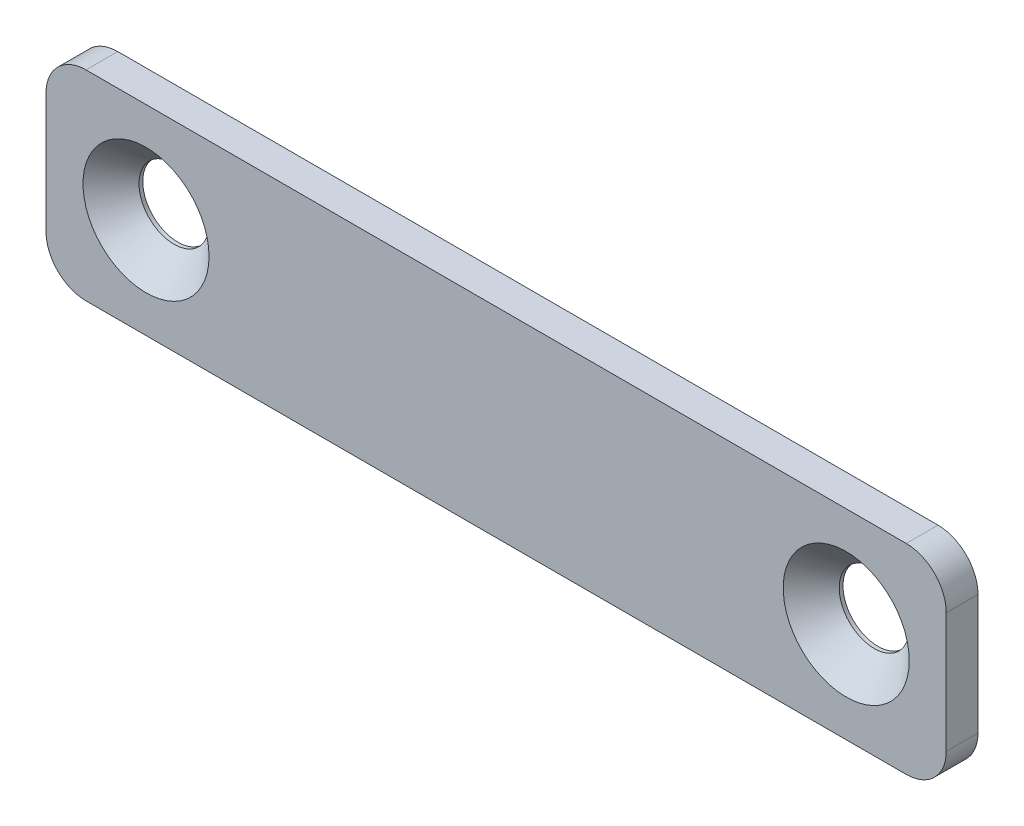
ISO-10303-21;
HEADER;
FILE_DESCRIPTION(('STEP AP214'),'2;1');
FILE_NAME('part.step','',(''),(''),'','','');
FILE_SCHEMA(('AUTOMOTIVE_DESIGN { 1 0 10303 214 1 1 1 1 }'));
ENDSEC;
DATA;
#1=APPLICATION_CONTEXT('core data for automotive mechanical design processes');
#2=APPLICATION_PROTOCOL_DEFINITION('international standard','automotive_design',2000,#1);
#3=PRODUCT_CONTEXT('',#1,'mechanical');
#4=PRODUCT('Part','Part','',(#3));
#5=PRODUCT_RELATED_PRODUCT_CATEGORY('part','',(#4));
#6=PRODUCT_DEFINITION_FORMATION('','',#4);
#7=PRODUCT_DEFINITION_CONTEXT('part definition',#1,'design');
#8=PRODUCT_DEFINITION('design','',#6,#7);
#9=PRODUCT_DEFINITION_SHAPE('','',#8);
#10=(LENGTH_UNIT() NAMED_UNIT(*) SI_UNIT(.MILLI.,.METRE.));
#11=(NAMED_UNIT(*) PLANE_ANGLE_UNIT() SI_UNIT($,.RADIAN.));
#12=(NAMED_UNIT(*) SI_UNIT($,.STERADIAN.) SOLID_ANGLE_UNIT());
#13=UNCERTAINTY_MEASURE_WITH_UNIT(LENGTH_MEASURE(1.E-05),#10,'distance_accuracy_value','');
#14=(GEOMETRIC_REPRESENTATION_CONTEXT(3) GLOBAL_UNCERTAINTY_ASSIGNED_CONTEXT((#13)) GLOBAL_UNIT_ASSIGNED_CONTEXT((#10,
#11,#12)) REPRESENTATION_CONTEXT('',''));
#15=CARTESIAN_POINT('',(0.,0.,0.));
#16=DIRECTION('',(0.,0.,1.));
#17=DIRECTION('',(1.,0.,0.));
#18=AXIS2_PLACEMENT_3D('',#15,#16,#17);
#19=CARTESIAN_POINT('',(0.,0.,1.5875));
#20=DIRECTION('',(0.,0.,-1.));
#21=DIRECTION('',(-1.,0.,0.));
#22=AXIS2_PLACEMENT_3D('',#19,#20,#21);
#23=PLANE('',#22);
#24=CARTESIAN_POINT('',(-17.5,0.,1.5875));
#25=DIRECTION('',(0.,0.,1.));
#26=DIRECTION('',(1.,0.,0.));
#27=AXIS2_PLACEMENT_3D('',#24,#25,#26);
#28=CIRCLE('',#27,3.15);
#29=CARTESIAN_POINT('',(-14.35,0.,1.5875));
#30=VERTEX_POINT('',#29);
#31=EDGE_CURVE('E202',#30,#30,#28,.T.);
#32=ORIENTED_EDGE('',*,*,#31,.F.);
#33=EDGE_LOOP('',(#32));
#34=FACE_BOUND('',#33,.T.);
#35=DIRECTION('',(-1.,0.,0.));
#36=VECTOR('',#35,1.);
#37=CARTESIAN_POINT('',(-22.5,4.99999999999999,1.5875));
#38=LINE('',#37,#36);
#39=CARTESIAN_POINT('',(20.4999999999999,4.99999999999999,1.5875));
#40=VERTEX_POINT('',#39);
#41=CARTESIAN_POINT('',(-20.5,4.99999999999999,1.5875));
#42=VERTEX_POINT('',#41);
#43=EDGE_CURVE('E210',#40,#42,#38,.T.);
#44=ORIENTED_EDGE('',*,*,#43,.T.);
#45=CARTESIAN_POINT('',(-20.5,2.99999999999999,1.5875));
#46=DIRECTION('',(0.,0.,-1.));
#47=DIRECTION('',(-1.,0.,0.));
#48=AXIS2_PLACEMENT_3D('',#45,#46,#47);
#49=CIRCLE('',#48,2.);
#50=CARTESIAN_POINT('',(-22.5,2.99999999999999,1.5875));
#51=VERTEX_POINT('',#50);
#52=EDGE_CURVE('E172',#42,#51,#49,.F.);
#53=ORIENTED_EDGE('',*,*,#52,.T.);
#54=DIRECTION('',(0.,-1.,0.));
#55=VECTOR('',#54,1.);
#56=CARTESIAN_POINT('',(-22.5,-5.00000000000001,1.5875));
#57=LINE('',#56,#55);
#58=CARTESIAN_POINT('',(-22.5,-3.00000000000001,1.5875));
#59=VERTEX_POINT('',#58);
#60=EDGE_CURVE('E128',#51,#59,#57,.T.);
#61=ORIENTED_EDGE('',*,*,#60,.T.);
#62=CARTESIAN_POINT('',(-20.5,-3.00000000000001,1.5875));
#63=DIRECTION('',(0.,0.,-1.));
#64=DIRECTION('',(-1.,0.,0.));
#65=AXIS2_PLACEMENT_3D('',#62,#63,#64);
#66=CIRCLE('',#65,2.);
#67=CARTESIAN_POINT('',(-20.5,-5.00000000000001,1.5875));
#68=VERTEX_POINT('',#67);
#69=EDGE_CURVE('E63',#59,#68,#66,.F.);
#70=ORIENTED_EDGE('',*,*,#69,.T.);
#71=DIRECTION('',(1.,0.,0.));
#72=VECTOR('',#71,1.);
#73=CARTESIAN_POINT('',(-22.5,-5.00000000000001,1.5875));
#74=LINE('',#73,#72);
#75=CARTESIAN_POINT('',(20.4999999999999,-5.00000000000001,1.5875));
#76=VERTEX_POINT('',#75);
#77=EDGE_CURVE('E151',#68,#76,#74,.T.);
#78=ORIENTED_EDGE('',*,*,#77,.T.);
#79=CARTESIAN_POINT('',(20.5,-3.00000000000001,1.5875));
#80=DIRECTION('',(0.,0.,-1.));
#81=DIRECTION('',(-1.,0.,0.));
#82=AXIS2_PLACEMENT_3D('',#79,#80,#81);
#83=CIRCLE('',#82,2.);
#84=CARTESIAN_POINT('',(22.5,-3.00000000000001,1.5875));
#85=VERTEX_POINT('',#84);
#86=EDGE_CURVE('E167',#76,#85,#83,.F.);
#87=ORIENTED_EDGE('',*,*,#86,.T.);
#88=DIRECTION('',(0.,1.,0.));
#89=VECTOR('',#88,1.);
#90=CARTESIAN_POINT('',(22.5,-5.00000000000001,1.5875));
#91=LINE('',#90,#89);
#92=CARTESIAN_POINT('',(22.5,2.99999999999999,1.5875));
#93=VERTEX_POINT('',#92);
#94=EDGE_CURVE('E143',#85,#93,#91,.T.);
#95=ORIENTED_EDGE('',*,*,#94,.T.);
#96=CARTESIAN_POINT('',(20.5,2.99999999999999,1.5875));
#97=DIRECTION('',(0.,0.,-1.));
#98=DIRECTION('',(-1.,0.,0.));
#99=AXIS2_PLACEMENT_3D('',#96,#97,#98);
#100=CIRCLE('',#99,2.);
#101=EDGE_CURVE('E164',#93,#40,#100,.F.);
#102=ORIENTED_EDGE('',*,*,#101,.T.);
#103=EDGE_LOOP('',(#44,#53,#61,#70,#78,#87,#95,#102));
#104=FACE_BOUND('',#103,.T.);
#105=CARTESIAN_POINT('',(17.5,0.,1.5875));
#106=DIRECTION('',(0.,0.,1.));
#107=DIRECTION('',(1.,0.,0.));
#108=AXIS2_PLACEMENT_3D('',#105,#106,#107);
#109=CIRCLE('',#108,3.15);
#110=CARTESIAN_POINT('',(20.65,0.,1.5875));
#111=VERTEX_POINT('',#110);
#112=EDGE_CURVE('E186',#111,#111,#109,.T.);
#113=ORIENTED_EDGE('',*,*,#112,.F.);
#114=EDGE_LOOP('',(#113));
#115=FACE_BOUND('',#114,.T.);
#116=ADVANCED_FACE('F38',(#34,#104,#115),#23,.F.);
#117=CARTESIAN_POINT('',(0.,0.,0.));
#118=DIRECTION('',(0.,0.,-1.));
#119=DIRECTION('',(-1.,0.,0.));
#120=AXIS2_PLACEMENT_3D('',#117,#118,#119);
#121=PLANE('',#120);
#122=CARTESIAN_POINT('',(17.5,0.,0.));
#123=DIRECTION('',(0.,0.,1.));
#124=DIRECTION('',(1.,0.,0.));
#125=AXIS2_PLACEMENT_3D('',#122,#123,#124);
#126=CIRCLE('',#125,1.75);
#127=CARTESIAN_POINT('',(19.25,0.,0.));
#128=VERTEX_POINT('',#127);
#129=EDGE_CURVE('E193',#128,#128,#126,.T.);
#130=ORIENTED_EDGE('',*,*,#129,.T.);
#131=EDGE_LOOP('',(#130));
#132=FACE_BOUND('',#131,.T.);
#133=DIRECTION('',(0.,-1.,0.));
#134=VECTOR('',#133,1.);
#135=CARTESIAN_POINT('',(-22.5,-5.00000000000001,0.));
#136=LINE('',#135,#134);
#137=CARTESIAN_POINT('',(-22.5,2.99999999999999,0.));
#138=VERTEX_POINT('',#137);
#139=CARTESIAN_POINT('',(-22.5,-3.00000000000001,0.));
#140=VERTEX_POINT('',#139);
#141=EDGE_CURVE('E126',#138,#140,#136,.T.);
#142=ORIENTED_EDGE('',*,*,#141,.F.);
#143=CARTESIAN_POINT('',(-20.5,2.99999999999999,0.));
#144=DIRECTION('',(0.,0.,-1.));
#145=DIRECTION('',(-1.,0.,0.));
#146=AXIS2_PLACEMENT_3D('',#143,#144,#145);
#147=CIRCLE('',#146,2.);
#148=CARTESIAN_POINT('',(-20.5,4.99999999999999,0.));
#149=VERTEX_POINT('',#148);
#150=EDGE_CURVE('E108',#138,#149,#147,.T.);
#151=ORIENTED_EDGE('',*,*,#150,.T.);
#152=DIRECTION('',(-1.,0.,0.));
#153=VECTOR('',#152,1.);
#154=CARTESIAN_POINT('',(-22.5,4.99999999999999,0.));
#155=LINE('',#154,#153);
#156=CARTESIAN_POINT('',(20.4999999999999,4.99999999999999,0.));
#157=VERTEX_POINT('',#156);
#158=EDGE_CURVE('E138',#157,#149,#155,.T.);
#159=ORIENTED_EDGE('',*,*,#158,.F.);
#160=CARTESIAN_POINT('',(20.5,2.99999999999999,0.));
#161=DIRECTION('',(0.,0.,-1.));
#162=DIRECTION('',(-1.,0.,0.));
#163=AXIS2_PLACEMENT_3D('',#160,#161,#162);
#164=CIRCLE('',#163,2.);
#165=CARTESIAN_POINT('',(22.5,2.99999999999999,0.));
#166=VERTEX_POINT('',#165);
#167=EDGE_CURVE('E130',#157,#166,#164,.T.);
#168=ORIENTED_EDGE('',*,*,#167,.T.);
#169=DIRECTION('',(0.,1.,0.));
#170=VECTOR('',#169,1.);
#171=CARTESIAN_POINT('',(22.5,-5.00000000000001,0.));
#172=LINE('',#171,#170);
#173=CARTESIAN_POINT('',(22.5,-3.00000000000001,0.));
#174=VERTEX_POINT('',#173);
#175=EDGE_CURVE('E146',#174,#166,#172,.T.);
#176=ORIENTED_EDGE('',*,*,#175,.F.);
#177=CARTESIAN_POINT('',(20.5,-3.00000000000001,0.));
#178=DIRECTION('',(0.,0.,-1.));
#179=DIRECTION('',(-1.,0.,0.));
#180=AXIS2_PLACEMENT_3D('',#177,#178,#179);
#181=CIRCLE('',#180,2.);
#182=CARTESIAN_POINT('',(20.4999999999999,-5.00000000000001,0.));
#183=VERTEX_POINT('',#182);
#184=EDGE_CURVE('E155',#174,#183,#181,.T.);
#185=ORIENTED_EDGE('',*,*,#184,.T.);
#186=DIRECTION('',(1.,0.,0.));
#187=VECTOR('',#186,1.);
#188=CARTESIAN_POINT('',(-22.5,-5.00000000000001,0.));
#189=LINE('',#188,#187);
#190=CARTESIAN_POINT('',(-20.5,-5.00000000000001,0.));
#191=VERTEX_POINT('',#190);
#192=EDGE_CURVE('E137',#191,#183,#189,.T.);
#193=ORIENTED_EDGE('',*,*,#192,.F.);
#194=CARTESIAN_POINT('',(-20.5,-3.00000000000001,0.));
#195=DIRECTION('',(0.,0.,-1.));
#196=DIRECTION('',(-1.,0.,0.));
#197=AXIS2_PLACEMENT_3D('',#194,#195,#196);
#198=CIRCLE('',#197,2.);
#199=EDGE_CURVE('E120',#191,#140,#198,.T.);
#200=ORIENTED_EDGE('',*,*,#199,.T.);
#201=EDGE_LOOP('',(#142,#151,#159,#168,#176,#185,#193,#200));
#202=FACE_BOUND('',#201,.T.);
#203=CARTESIAN_POINT('',(-17.5,0.,0.));
#204=DIRECTION('',(0.,0.,1.));
#205=DIRECTION('',(-1.,0.,0.));
#206=AXIS2_PLACEMENT_3D('',#203,#204,#205);
#207=CIRCLE('',#206,1.75);
#208=CARTESIAN_POINT('',(-19.25,0.,0.));
#209=VERTEX_POINT('',#208);
#210=EDGE_CURVE('E185',#209,#209,#207,.T.);
#211=ORIENTED_EDGE('',*,*,#210,.T.);
#212=EDGE_LOOP('',(#211));
#213=FACE_BOUND('',#212,.T.);
#214=ADVANCED_FACE('F133',(#132,#202,#213),#121,.T.);
#215=CARTESIAN_POINT('',(22.5,-5.00000000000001,1.5875));
#216=DIRECTION('',(-1.,0.,0.));
#217=DIRECTION('',(0.,0.,1.));
#218=AXIS2_PLACEMENT_3D('',#215,#216,#217);
#219=PLANE('',#218);
#220=ORIENTED_EDGE('',*,*,#94,.F.);
#221=DIRECTION('',(0.,0.,-1.));
#222=VECTOR('',#221,1.);
#223=CARTESIAN_POINT('',(22.5,-3.00000000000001,1.5875));
#224=LINE('',#223,#222);
#225=EDGE_CURVE('E11',#85,#174,#224,.T.);
#226=ORIENTED_EDGE('',*,*,#225,.T.);
#227=ORIENTED_EDGE('',*,*,#175,.T.);
#228=DIRECTION('',(0.,0.,-1.));
#229=VECTOR('',#228,1.);
#230=CARTESIAN_POINT('',(22.5,2.99999999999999,1.5875));
#231=LINE('',#230,#229);
#232=EDGE_CURVE('E48',#166,#93,#231,.F.);
#233=ORIENTED_EDGE('',*,*,#232,.T.);
#234=EDGE_LOOP('',(#220,#226,#227,#233));
#235=FACE_BOUND('',#234,.T.);
#236=ADVANCED_FACE('F222',(#235),#219,.F.);
#237=CARTESIAN_POINT('',(-22.5,4.99999999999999,1.5875));
#238=DIRECTION('',(0.,-1.,0.));
#239=DIRECTION('',(0.,0.,-1.));
#240=AXIS2_PLACEMENT_3D('',#237,#238,#239);
#241=PLANE('',#240);
#242=ORIENTED_EDGE('',*,*,#158,.T.);
#243=DIRECTION('',(0.,0.,-1.));
#244=VECTOR('',#243,1.);
#245=CARTESIAN_POINT('',(-20.5,4.99999999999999,1.5875));
#246=LINE('',#245,#244);
#247=EDGE_CURVE('E113',#149,#42,#246,.F.);
#248=ORIENTED_EDGE('',*,*,#247,.T.);
#249=ORIENTED_EDGE('',*,*,#43,.F.);
#250=DIRECTION('',(0.,0.,-1.));
#251=VECTOR('',#250,1.);
#252=CARTESIAN_POINT('',(20.5,4.99999999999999,1.5875));
#253=LINE('',#252,#251);
#254=EDGE_CURVE('E119',#40,#157,#253,.T.);
#255=ORIENTED_EDGE('',*,*,#254,.T.);
#256=EDGE_LOOP('',(#242,#248,#249,#255));
#257=FACE_BOUND('',#256,.T.);
#258=ADVANCED_FACE('F230',(#257),#241,.F.);
#259=CARTESIAN_POINT('',(-22.5,-5.00000000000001,1.5875));
#260=DIRECTION('',(1.,0.,0.));
#261=DIRECTION('',(0.,0.,-1.));
#262=AXIS2_PLACEMENT_3D('',#259,#260,#261);
#263=PLANE('',#262);
#264=ORIENTED_EDGE('',*,*,#60,.F.);
#265=DIRECTION('',(0.,0.,-1.));
#266=VECTOR('',#265,1.);
#267=CARTESIAN_POINT('',(-22.5,2.99999999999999,1.5875));
#268=LINE('',#267,#266);
#269=EDGE_CURVE('E112',#51,#138,#268,.T.);
#270=ORIENTED_EDGE('',*,*,#269,.T.);
#271=ORIENTED_EDGE('',*,*,#141,.T.);
#272=DIRECTION('',(0.,0.,-1.));
#273=VECTOR('',#272,1.);
#274=CARTESIAN_POINT('',(-22.5,-3.00000000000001,1.5875));
#275=LINE('',#274,#273);
#276=EDGE_CURVE('E131',#140,#59,#275,.F.);
#277=ORIENTED_EDGE('',*,*,#276,.T.);
#278=EDGE_LOOP('',(#264,#270,#271,#277));
#279=FACE_BOUND('',#278,.T.);
#280=ADVANCED_FACE('F125',(#279),#263,.F.);
#281=CARTESIAN_POINT('',(-22.5,-5.00000000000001,1.5875));
#282=DIRECTION('',(0.,1.,0.));
#283=DIRECTION('',(0.,0.,1.));
#284=AXIS2_PLACEMENT_3D('',#281,#282,#283);
#285=PLANE('',#284);
#286=ORIENTED_EDGE('',*,*,#77,.F.);
#287=DIRECTION('',(0.,0.,-1.));
#288=VECTOR('',#287,1.);
#289=CARTESIAN_POINT('',(-20.5,-5.00000000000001,1.5875));
#290=LINE('',#289,#288);
#291=EDGE_CURVE('E177',#68,#191,#290,.T.);
#292=ORIENTED_EDGE('',*,*,#291,.T.);
#293=ORIENTED_EDGE('',*,*,#192,.T.);
#294=DIRECTION('',(0.,0.,-1.));
#295=VECTOR('',#294,1.);
#296=CARTESIAN_POINT('',(20.5,-5.00000000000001,1.5875));
#297=LINE('',#296,#295);
#298=EDGE_CURVE('E56',#183,#76,#297,.F.);
#299=ORIENTED_EDGE('',*,*,#298,.T.);
#300=EDGE_LOOP('',(#286,#292,#293,#299));
#301=FACE_BOUND('',#300,.T.);
#302=ADVANCED_FACE('F237',(#301),#285,.F.);
#303=CARTESIAN_POINT('',(17.5,0.,1.5875));
#304=DIRECTION('',(0.,0.,-1.));
#305=DIRECTION('',(-1.,0.,0.));
#306=AXIS2_PLACEMENT_3D('',#303,#304,#305);
#307=CYLINDRICAL_SURFACE('',#306,1.75);
#308=CARTESIAN_POINT('',(17.5,0.,0.187500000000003));
#309=DIRECTION('',(0.,0.,1.));
#310=DIRECTION('',(1.,0.,0.));
#311=AXIS2_PLACEMENT_3D('',#308,#309,#310);
#312=CIRCLE('',#311,1.75);
#313=CARTESIAN_POINT('',(19.25,0.,0.187500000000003));
#314=VERTEX_POINT('',#313);
#315=EDGE_CURVE('E182',#314,#314,#312,.F.);
#316=ORIENTED_EDGE('',*,*,#315,.F.);
#317=EDGE_LOOP('',(#316));
#318=FACE_BOUND('',#317,.T.);
#319=ORIENTED_EDGE('',*,*,#129,.F.);
#320=EDGE_LOOP('',(#319));
#321=FACE_BOUND('',#320,.T.);
#322=ADVANCED_FACE('F250',(#318,#321),#307,.F.);
#323=CARTESIAN_POINT('',(-17.5,0.,1.5875));
#324=DIRECTION('',(0.,0.,-1.));
#325=DIRECTION('',(-1.,0.,0.));
#326=AXIS2_PLACEMENT_3D('',#323,#324,#325);
#327=CYLINDRICAL_SURFACE('',#326,1.75);
#328=CARTESIAN_POINT('',(-17.5,0.,0.187500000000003));
#329=DIRECTION('',(0.,0.,1.));
#330=DIRECTION('',(1.,0.,0.));
#331=AXIS2_PLACEMENT_3D('',#328,#329,#330);
#332=CIRCLE('',#331,1.75);
#333=CARTESIAN_POINT('',(-15.75,0.,0.187500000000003));
#334=VERTEX_POINT('',#333);
#335=EDGE_CURVE('E42',#334,#334,#332,.F.);
#336=ORIENTED_EDGE('',*,*,#335,.F.);
#337=EDGE_LOOP('',(#336));
#338=FACE_BOUND('',#337,.T.);
#339=ORIENTED_EDGE('',*,*,#210,.F.);
#340=EDGE_LOOP('',(#339));
#341=FACE_BOUND('',#340,.T.);
#342=ADVANCED_FACE('F257',(#338,#341),#327,.F.);
#343=CARTESIAN_POINT('',(-20.5,2.99999999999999,1.5875));
#344=DIRECTION('',(0.,0.,-1.));
#345=DIRECTION('',(-1.,0.,0.));
#346=AXIS2_PLACEMENT_3D('',#343,#344,#345);
#347=CYLINDRICAL_SURFACE('',#346,2.);
#348=ORIENTED_EDGE('',*,*,#52,.F.);
#349=ORIENTED_EDGE('',*,*,#247,.F.);
#350=ORIENTED_EDGE('',*,*,#150,.F.);
#351=ORIENTED_EDGE('',*,*,#269,.F.);
#352=EDGE_LOOP('',(#348,#349,#350,#351));
#353=FACE_BOUND('',#352,.T.);
#354=ADVANCED_FACE('F111',(#353),#347,.T.);
#355=CARTESIAN_POINT('',(-20.5,-3.00000000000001,1.5875));
#356=DIRECTION('',(0.,0.,-1.));
#357=DIRECTION('',(-1.,0.,0.));
#358=AXIS2_PLACEMENT_3D('',#355,#356,#357);
#359=CYLINDRICAL_SURFACE('',#358,2.);
#360=ORIENTED_EDGE('',*,*,#69,.F.);
#361=ORIENTED_EDGE('',*,*,#276,.F.);
#362=ORIENTED_EDGE('',*,*,#199,.F.);
#363=ORIENTED_EDGE('',*,*,#291,.F.);
#364=EDGE_LOOP('',(#360,#361,#362,#363));
#365=FACE_BOUND('',#364,.T.);
#366=ADVANCED_FACE('F262',(#365),#359,.T.);
#367=CARTESIAN_POINT('',(20.5,-3.00000000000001,1.5875));
#368=DIRECTION('',(0.,0.,-1.));
#369=DIRECTION('',(-1.,0.,0.));
#370=AXIS2_PLACEMENT_3D('',#367,#368,#369);
#371=CYLINDRICAL_SURFACE('',#370,2.);
#372=ORIENTED_EDGE('',*,*,#86,.F.);
#373=ORIENTED_EDGE('',*,*,#298,.F.);
#374=ORIENTED_EDGE('',*,*,#184,.F.);
#375=ORIENTED_EDGE('',*,*,#225,.F.);
#376=EDGE_LOOP('',(#372,#373,#374,#375));
#377=FACE_BOUND('',#376,.T.);
#378=ADVANCED_FACE('F264',(#377),#371,.T.);
#379=CARTESIAN_POINT('',(20.5,2.99999999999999,1.5875));
#380=DIRECTION('',(0.,0.,-1.));
#381=DIRECTION('',(-1.,0.,0.));
#382=AXIS2_PLACEMENT_3D('',#379,#380,#381);
#383=CYLINDRICAL_SURFACE('',#382,2.);
#384=ORIENTED_EDGE('',*,*,#101,.F.);
#385=ORIENTED_EDGE('',*,*,#232,.F.);
#386=ORIENTED_EDGE('',*,*,#167,.F.);
#387=ORIENTED_EDGE('',*,*,#254,.F.);
#388=EDGE_LOOP('',(#384,#385,#386,#387));
#389=FACE_BOUND('',#388,.T.);
#390=ADVANCED_FACE('F40',(#389),#383,.T.);
#391=CARTESIAN_POINT('',(17.5,0.,1.5875));
#392=DIRECTION('',(0.,0.,1.));
#393=DIRECTION('',(1.,0.,0.));
#394=AXIS2_PLACEMENT_3D('',#391,#392,#393);
#395=CONICAL_SURFACE('',#394,3.15,0.785398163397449);
#396=ORIENTED_EDGE('',*,*,#315,.T.);
#397=EDGE_LOOP('',(#396));
#398=FACE_BOUND('',#397,.T.);
#399=ORIENTED_EDGE('',*,*,#112,.T.);
#400=EDGE_LOOP('',(#399));
#401=FACE_BOUND('',#400,.T.);
#402=ADVANCED_FACE('F281',(#398,#401),#395,.F.);
#403=CARTESIAN_POINT('',(-17.5,0.,1.5875));
#404=DIRECTION('',(0.,0.,1.));
#405=DIRECTION('',(1.,0.,0.));
#406=AXIS2_PLACEMENT_3D('',#403,#404,#405);
#407=CONICAL_SURFACE('',#406,3.15,0.785398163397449);
#408=ORIENTED_EDGE('',*,*,#335,.T.);
#409=EDGE_LOOP('',(#408));
#410=FACE_BOUND('',#409,.T.);
#411=ORIENTED_EDGE('',*,*,#31,.T.);
#412=EDGE_LOOP('',(#411));
#413=FACE_BOUND('',#412,.T.);
#414=ADVANCED_FACE('F284',(#410,#413),#407,.F.);
#415=CLOSED_SHELL('',(#116,#214,#236,#258,#280,#302,#322,#342,#354,#366,#378,#390,#402,#414));
#416=MANIFOLD_SOLID_BREP('B2',#415);
#417=ADVANCED_BREP_SHAPE_REPRESENTATION('',(#18,#416),#14);
#418=SHAPE_DEFINITION_REPRESENTATION(#9,#417);
ENDSEC;
END-ISO-10303-21;
